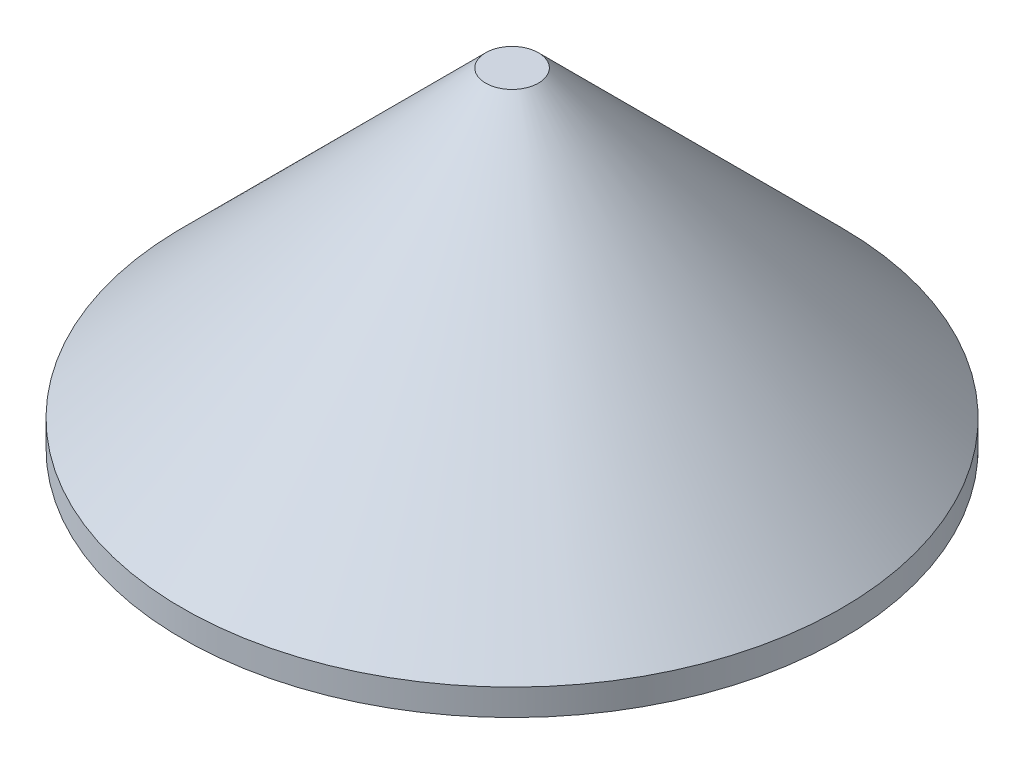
ISO-10303-21;
HEADER;
FILE_DESCRIPTION(('STEP AP214'),'2;1');
FILE_NAME('part.step','',(''),(''),'','','');
FILE_SCHEMA(('AUTOMOTIVE_DESIGN { 1 0 10303 214 1 1 1 1 }'));
ENDSEC;
DATA;
#1=APPLICATION_CONTEXT('core data for automotive mechanical design processes');
#2=APPLICATION_PROTOCOL_DEFINITION('international standard','automotive_design',2000,#1);
#3=PRODUCT_CONTEXT('',#1,'mechanical');
#4=PRODUCT('Part','Part','',(#3));
#5=PRODUCT_RELATED_PRODUCT_CATEGORY('part','',(#4));
#6=PRODUCT_DEFINITION_FORMATION('','',#4);
#7=PRODUCT_DEFINITION_CONTEXT('part definition',#1,'design');
#8=PRODUCT_DEFINITION('design','',#6,#7);
#9=PRODUCT_DEFINITION_SHAPE('','',#8);
#10=(LENGTH_UNIT() NAMED_UNIT(*) SI_UNIT(.MILLI.,.METRE.));
#11=(NAMED_UNIT(*) PLANE_ANGLE_UNIT() SI_UNIT($,.RADIAN.));
#12=(NAMED_UNIT(*) SI_UNIT($,.STERADIAN.) SOLID_ANGLE_UNIT());
#13=UNCERTAINTY_MEASURE_WITH_UNIT(LENGTH_MEASURE(1.E-05),#10,'distance_accuracy_value','');
#14=(GEOMETRIC_REPRESENTATION_CONTEXT(3) GLOBAL_UNCERTAINTY_ASSIGNED_CONTEXT((#13)) GLOBAL_UNIT_ASSIGNED_CONTEXT((#10,
#11,#12)) REPRESENTATION_CONTEXT('',''));
#15=CARTESIAN_POINT('',(0.,0.,0.));
#16=DIRECTION('',(0.,0.,1.));
#17=DIRECTION('',(1.,0.,0.));
#18=AXIS2_PLACEMENT_3D('',#15,#16,#17);
#19=CARTESIAN_POINT('',(0.,0.,0.));
#20=DIRECTION('',(0.,-1.,0.));
#21=DIRECTION('',(0.,0.,-1.));
#22=AXIS2_PLACEMENT_3D('',#19,#20,#21);
#23=PLANE('',#22);
#24=CARTESIAN_POINT('',(0.,0.,0.));
#25=DIRECTION('',(0.,-1.,0.));
#26=DIRECTION('',(0.,0.,-1.));
#27=AXIS2_PLACEMENT_3D('',#24,#25,#26);
#28=CIRCLE('',#27,25.);
#29=CARTESIAN_POINT('',(0.,0.,-25.));
#30=VERTEX_POINT('',#29);
#31=EDGE_CURVE('E10',#30,#30,#28,.T.);
#32=ORIENTED_EDGE('',*,*,#31,.T.);
#33=EDGE_LOOP('',(#32));
#34=FACE_BOUND('',#33,.T.);
#35=ADVANCED_FACE('F31',(#34),#23,.T.);
#36=CARTESIAN_POINT('',(0.,0.,0.));
#37=DIRECTION('',(0.,-1.,0.));
#38=DIRECTION('',(0.,0.,-1.));
#39=AXIS2_PLACEMENT_3D('',#36,#37,#38);
#40=CYLINDRICAL_SURFACE('',#39,25.);
#41=CARTESIAN_POINT('',(0.,2.,0.));
#42=DIRECTION('',(0.,-1.,0.));
#43=DIRECTION('',(0.,0.,-1.));
#44=AXIS2_PLACEMENT_3D('',#41,#42,#43);
#45=CIRCLE('',#44,25.);
#46=CARTESIAN_POINT('',(0.,2.,-25.));
#47=VERTEX_POINT('',#46);
#48=EDGE_CURVE('E37',#47,#47,#45,.T.);
#49=ORIENTED_EDGE('',*,*,#48,.T.);
#50=EDGE_LOOP('',(#49));
#51=FACE_BOUND('',#50,.T.);
#52=ORIENTED_EDGE('',*,*,#31,.F.);
#53=EDGE_LOOP('',(#52));
#54=FACE_BOUND('',#53,.T.);
#55=ADVANCED_FACE('F57',(#51,#54),#40,.T.);
#56=CARTESIAN_POINT('',(0.,2.,0.));
#57=DIRECTION('',(0.,-1.,0.));
#58=DIRECTION('',(0.,0.,-1.));
#59=AXIS2_PLACEMENT_3D('',#56,#57,#58);
#60=CONICAL_SURFACE('',#59,25.,0.785398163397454);
#61=CARTESIAN_POINT('',(0.,25.,0.));
#62=DIRECTION('',(0.,-1.,0.));
#63=DIRECTION('',(0.,0.,-1.));
#64=AXIS2_PLACEMENT_3D('',#61,#62,#63);
#65=CIRCLE('',#64,1.99999999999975);
#66=CARTESIAN_POINT('',(0.,25.,-1.99999999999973));
#67=VERTEX_POINT('',#66);
#68=EDGE_CURVE('E41',#67,#67,#65,.T.);
#69=CARTESIAN_POINT('',(0.,25.,-1.99999999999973));
#70=CARTESIAN_POINT('',(0.,24.7604166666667,-2.23958333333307));
#71=CARTESIAN_POINT('',(0.,24.5208333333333,-2.4791666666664));
#72=CARTESIAN_POINT('',(0.,24.0416666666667,-2.95833333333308));
#73=CARTESIAN_POINT('',(0.,23.8020833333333,-3.19791666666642));
#74=CARTESIAN_POINT('',(0.,23.3229166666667,-3.67708333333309));
#75=CARTESIAN_POINT('',(0.,23.0833333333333,-3.91666666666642));
#76=CARTESIAN_POINT('',(0.,22.6041666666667,-4.3958333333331));
#77=CARTESIAN_POINT('',(0.,22.3645833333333,-4.63541666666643));
#78=CARTESIAN_POINT('',(0.,21.8854166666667,-5.1145833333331));
#79=CARTESIAN_POINT('',(0.,21.6458333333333,-5.35416666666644));
#80=CARTESIAN_POINT('',(0.,21.1666666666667,-5.83333333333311));
#81=CARTESIAN_POINT('',(0.,20.9270833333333,-6.07291666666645));
#82=CARTESIAN_POINT('',(0.,20.4479166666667,-6.55208333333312));
#83=CARTESIAN_POINT('',(0.,20.2083333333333,-6.79166666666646));
#84=CARTESIAN_POINT('',(0.,19.7291666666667,-7.27083333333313));
#85=CARTESIAN_POINT('',(0.,19.4895833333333,-7.51041666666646));
#86=CARTESIAN_POINT('',(0.,19.0104166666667,-7.98958333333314));
#87=CARTESIAN_POINT('',(0.,18.7708333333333,-8.22916666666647));
#88=CARTESIAN_POINT('',(0.,18.2916666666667,-8.70833333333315));
#89=CARTESIAN_POINT('',(0.,18.0520833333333,-8.94791666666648));
#90=CARTESIAN_POINT('',(0.,17.5729166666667,-9.42708333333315));
#91=CARTESIAN_POINT('',(0.,17.3333333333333,-9.66666666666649));
#92=CARTESIAN_POINT('',(0.,16.8541666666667,-10.1458333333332));
#93=CARTESIAN_POINT('',(0.,16.6145833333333,-10.3854166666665));
#94=CARTESIAN_POINT('',(0.,16.1354166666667,-10.8645833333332));
#95=CARTESIAN_POINT('',(0.,15.8958333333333,-11.1041666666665));
#96=CARTESIAN_POINT('',(0.,15.4166666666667,-11.5833333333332));
#97=CARTESIAN_POINT('',(0.,15.1770833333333,-11.8229166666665));
#98=CARTESIAN_POINT('',(0.,14.6979166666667,-12.3020833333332));
#99=CARTESIAN_POINT('',(0.,14.4583333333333,-12.5416666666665));
#100=CARTESIAN_POINT('',(0.,13.9791666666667,-13.0208333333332));
#101=CARTESIAN_POINT('',(0.,13.7395833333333,-13.2604166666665));
#102=CARTESIAN_POINT('',(0.,13.2604166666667,-13.7395833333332));
#103=CARTESIAN_POINT('',(0.,13.0208333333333,-13.9791666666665));
#104=CARTESIAN_POINT('',(0.,12.5416666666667,-14.4583333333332));
#105=CARTESIAN_POINT('',(0.,12.3020833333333,-14.6979166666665));
#106=CARTESIAN_POINT('',(0.,11.8229166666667,-15.1770833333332));
#107=CARTESIAN_POINT('',(0.,11.5833333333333,-15.4166666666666));
#108=CARTESIAN_POINT('',(0.,11.1041666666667,-15.8958333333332));
#109=CARTESIAN_POINT('',(0.,10.8645833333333,-16.1354166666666));
#110=CARTESIAN_POINT('',(0.,10.3854166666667,-16.6145833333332));
#111=CARTESIAN_POINT('',(0.,10.1458333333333,-16.8541666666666));
#112=CARTESIAN_POINT('',(0.,9.66666666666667,-17.3333333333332));
#113=CARTESIAN_POINT('',(0.,9.42708333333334,-17.5729166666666));
#114=CARTESIAN_POINT('',(0.,8.94791666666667,-18.0520833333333));
#115=CARTESIAN_POINT('',(0.,8.70833333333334,-18.2916666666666));
#116=CARTESIAN_POINT('',(0.,8.22916666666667,-18.7708333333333));
#117=CARTESIAN_POINT('',(0.,7.98958333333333,-19.0104166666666));
#118=CARTESIAN_POINT('',(0.,7.51041666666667,-19.4895833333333));
#119=CARTESIAN_POINT('',(0.,7.27083333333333,-19.7291666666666));
#120=CARTESIAN_POINT('',(0.,6.79166666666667,-20.2083333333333));
#121=CARTESIAN_POINT('',(0.,6.55208333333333,-20.4479166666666));
#122=CARTESIAN_POINT('',(0.,6.07291666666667,-20.9270833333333));
#123=CARTESIAN_POINT('',(0.,5.83333333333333,-21.1666666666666));
#124=CARTESIAN_POINT('',(0.,5.35416666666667,-21.6458333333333));
#125=CARTESIAN_POINT('',(0.,5.11458333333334,-21.8854166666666));
#126=CARTESIAN_POINT('',(0.,4.63541666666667,-22.3645833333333));
#127=CARTESIAN_POINT('',(0.,4.39583333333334,-22.6041666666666));
#128=CARTESIAN_POINT('',(0.,3.91666666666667,-23.0833333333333));
#129=CARTESIAN_POINT('',(0.,3.67708333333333,-23.3229166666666));
#130=CARTESIAN_POINT('',(0.,3.19791666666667,-23.8020833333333));
#131=CARTESIAN_POINT('',(0.,2.95833333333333,-24.0416666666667));
#132=CARTESIAN_POINT('',(0.,2.47916666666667,-24.5208333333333));
#133=CARTESIAN_POINT('',(0.,2.23958333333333,-24.7604166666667));
#134=CARTESIAN_POINT('',(0.,2.,-25.));
#135=B_SPLINE_CURVE_WITH_KNOTS('',3,(#69,#70,#71,#72,#73,#74,#75,#76,#77,#78,#79,#80,#81,#82,
#83,#84,#85,#86,#87,#88,#89,#90,#91,#92,#93,#94,#95,#96,#97,#98,#99,#100,#101,#102,#103,#104,
#105,#106,#107,#108,#109,#110,#111,#112,#113,#114,#115,#116,#117,#118,#119,#120,#121,#122,#123,
#124,#125,#126,#127,#128,#129,#130,#131,#132,#133,#134),.UNSPECIFIED.,.F.,.F.,(4,2,2,2,2,2,2,2,
2,2,2,2,2,2,2,2,2,2,2,2,2,2,2,2,2,2,2,2,2,2,2,2,4),(0.,1.01646599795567,2.03293199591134,
3.04939799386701,4.06586399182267,5.08232998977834,6.09879598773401,7.11526198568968,
8.13172798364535,9.14819398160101,10.1646599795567,11.1811259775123,12.197591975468,
13.2140579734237,14.2305239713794,15.246989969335,16.2634559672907,17.2799219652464,
18.296387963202,19.3128539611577,20.3293199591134,21.345785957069,22.3622519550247,
23.3787179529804,24.395183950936,25.4116499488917,26.4281159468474,27.444581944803,
28.4610479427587,29.4775139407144,30.49397993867,31.5104459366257,32.5269119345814),.UNSPECIFIED.);
#136=EDGE_CURVE('BSEAM48',#67,#47,#135,.T.);
#137=ORIENTED_EDGE('',*,*,#68,.T.);
#138=ORIENTED_EDGE('',*,*,#48,.F.);
#139=ORIENTED_EDGE('',*,*,#136,.T.);
#140=ORIENTED_EDGE('',*,*,#136,.F.);
#141=EDGE_LOOP('',(#137,#139,#138,#140));
#142=FACE_BOUND('',#141,.T.);
#143=ADVANCED_FACE('F48',(#142),#60,.T.);
#144=CARTESIAN_POINT('',(1.99999999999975,25.,0.));
#145=DIRECTION('',(0.,1.,0.));
#146=DIRECTION('',(0.,0.,1.));
#147=AXIS2_PLACEMENT_3D('',#144,#145,#146);
#148=PLANE('',#147);
#149=ORIENTED_EDGE('',*,*,#68,.F.);
#150=EDGE_LOOP('',(#149));
#151=FACE_BOUND('',#150,.T.);
#152=ADVANCED_FACE('F51',(#151),#148,.T.);
#153=CLOSED_SHELL('',(#35,#55,#143,#152));
#154=MANIFOLD_SOLID_BREP('B2',#153);
#155=ADVANCED_BREP_SHAPE_REPRESENTATION('',(#18,#154),#14);
#156=SHAPE_DEFINITION_REPRESENTATION(#9,#155);
ENDSEC;
END-ISO-10303-21;
